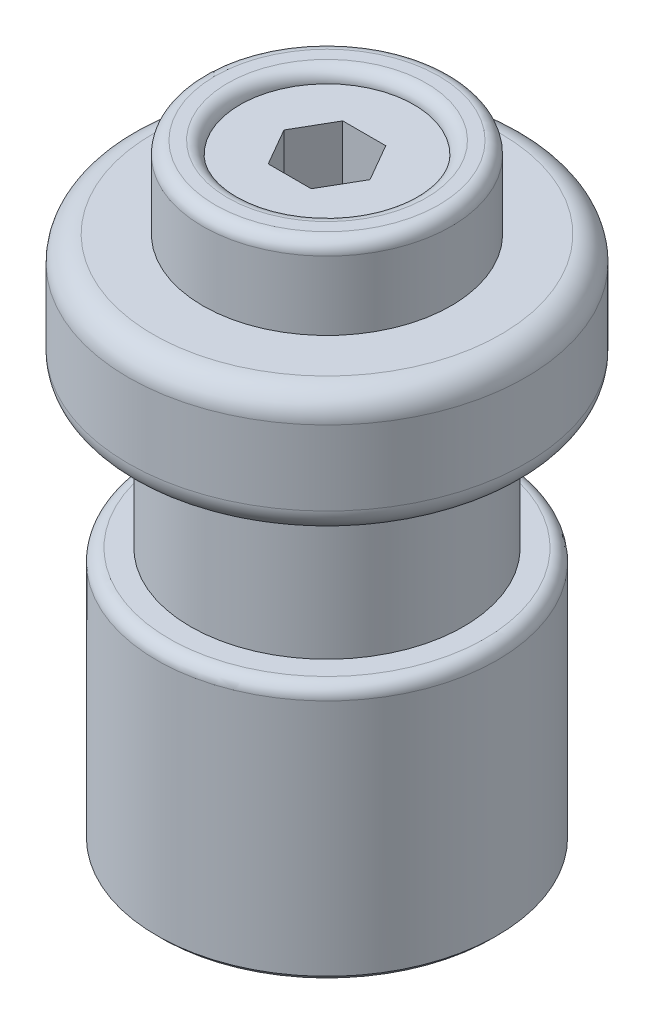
ISO-10303-21;
HEADER;
FILE_DESCRIPTION(('STEP AP214'),'2;1');
FILE_NAME('part.step','',(''),(''),'','','');
FILE_SCHEMA(('AUTOMOTIVE_DESIGN { 1 0 10303 214 1 1 1 1 }'));
ENDSEC;
DATA;
#1=APPLICATION_CONTEXT('core data for automotive mechanical design processes');
#2=APPLICATION_PROTOCOL_DEFINITION('international standard','automotive_design',2000,#1);
#3=PRODUCT_CONTEXT('',#1,'mechanical');
#4=PRODUCT('Part','Part','',(#3));
#5=PRODUCT_RELATED_PRODUCT_CATEGORY('part','',(#4));
#6=PRODUCT_DEFINITION_FORMATION('','',#4);
#7=PRODUCT_DEFINITION_CONTEXT('part definition',#1,'design');
#8=PRODUCT_DEFINITION('design','',#6,#7);
#9=PRODUCT_DEFINITION_SHAPE('','',#8);
#10=(LENGTH_UNIT() NAMED_UNIT(*) SI_UNIT(.MILLI.,.METRE.));
#11=(NAMED_UNIT(*) PLANE_ANGLE_UNIT() SI_UNIT($,.RADIAN.));
#12=(NAMED_UNIT(*) SI_UNIT($,.STERADIAN.) SOLID_ANGLE_UNIT());
#13=UNCERTAINTY_MEASURE_WITH_UNIT(LENGTH_MEASURE(1.E-05),#10,'distance_accuracy_value','');
#14=(GEOMETRIC_REPRESENTATION_CONTEXT(3) GLOBAL_UNCERTAINTY_ASSIGNED_CONTEXT((#13)) GLOBAL_UNIT_ASSIGNED_CONTEXT((#10,
#11,#12)) REPRESENTATION_CONTEXT('',''));
#15=CARTESIAN_POINT('',(0.,0.,0.));
#16=DIRECTION('',(0.,0.,1.));
#17=DIRECTION('',(1.,0.,0.));
#18=AXIS2_PLACEMENT_3D('',#15,#16,#17);
#19=CARTESIAN_POINT('',(0.,10.3,0.));
#20=DIRECTION('',(0.,1.,0.));
#21=DIRECTION('',(0.,0.,1.));
#22=AXIS2_PLACEMENT_3D('',#19,#20,#21);
#23=PLANE('',#22);
#24=CARTESIAN_POINT('',(0.,10.3,0.));
#25=DIRECTION('',(0.,1.,0.));
#26=DIRECTION('',(0.,0.,1.));
#27=AXIS2_PLACEMENT_3D('',#24,#25,#26);
#28=CIRCLE('',#27,5.5);
#29=CARTESIAN_POINT('',(0.,10.3,5.5));
#30=VERTEX_POINT('',#29);
#31=EDGE_CURVE('E157',#30,#30,#28,.F.);
#32=ORIENTED_EDGE('',*,*,#31,.T.);
#33=EDGE_LOOP('',(#32));
#34=FACE_BOUND('',#33,.T.);
#35=CARTESIAN_POINT('',(0.,10.3,0.));
#36=DIRECTION('',(0.,-1.,0.));
#37=DIRECTION('',(-0.0644651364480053,0.,0.997919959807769));
#38=AXIS2_PLACEMENT_3D('',#35,#36,#37);
#39=CIRCLE('',#38,6.35);
#40=CARTESIAN_POINT('',(-0.409353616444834,10.3,6.33679174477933));
#41=VERTEX_POINT('',#40);
#42=EDGE_CURVE('E82',#41,#41,#39,.F.);
#43=ORIENTED_EDGE('',*,*,#42,.T.);
#44=EDGE_LOOP('',(#43));
#45=FACE_BOUND('',#44,.T.);
#46=ADVANCED_FACE('F15',(#34,#45),#23,.T.);
#47=CARTESIAN_POINT('',(0.,15.235225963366,0.));
#48=DIRECTION('',(0.,-1.,0.));
#49=DIRECTION('',(0.,0.,-1.));
#50=AXIS2_PLACEMENT_3D('',#47,#48,#49);
#51=TOROIDAL_SURFACE('',#50,6.5,1.);
#52=CARTESIAN_POINT('',(0.,15.235225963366,0.));
#53=DIRECTION('',(0.,-1.,0.));
#54=DIRECTION('',(0.,0.,-1.));
#55=AXIS2_PLACEMENT_3D('',#52,#53,#54);
#56=CIRCLE('',#55,5.5);
#57=CARTESIAN_POINT('',(0.,15.235225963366,-5.5));
#58=VERTEX_POINT('',#57);
#59=EDGE_CURVE('E137',#58,#58,#56,.T.);
#60=ORIENTED_EDGE('',*,*,#59,.F.);
#61=EDGE_LOOP('',(#60));
#62=FACE_BOUND('',#61,.T.);
#63=CARTESIAN_POINT('',(0.,16.235225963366,0.));
#64=DIRECTION('',(0.,-1.,0.));
#65=DIRECTION('',(0.,0.,-1.));
#66=AXIS2_PLACEMENT_3D('',#63,#64,#65);
#67=CIRCLE('',#66,6.5);
#68=CARTESIAN_POINT('',(0.,16.235225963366,-6.5));
#69=VERTEX_POINT('',#68);
#70=EDGE_CURVE('E133',#69,#69,#67,.T.);
#71=ORIENTED_EDGE('',*,*,#70,.T.);
#72=EDGE_LOOP('',(#71));
#73=FACE_BOUND('',#72,.T.);
#74=ADVANCED_FACE('F222',(#62,#73),#51,.F.);
#75=CARTESIAN_POINT('',(0.,6.23522596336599,0.));
#76=DIRECTION('',(0.,-1.,0.));
#77=DIRECTION('',(0.,0.,-1.));
#78=AXIS2_PLACEMENT_3D('',#75,#76,#77);
#79=CYLINDRICAL_SURFACE('',#78,5.5);
#80=ORIENTED_EDGE('',*,*,#31,.F.);
#81=EDGE_LOOP('',(#80));
#82=FACE_BOUND('',#81,.T.);
#83=ORIENTED_EDGE('',*,*,#59,.T.);
#84=EDGE_LOOP('',(#83));
#85=FACE_BOUND('',#84,.T.);
#86=ADVANCED_FACE('F228',(#82,#85),#79,.T.);
#87=CARTESIAN_POINT('',(0.,6.23522596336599,0.));
#88=DIRECTION('',(0.,-1.,0.));
#89=DIRECTION('',(0.,0.,-1.));
#90=AXIS2_PLACEMENT_3D('',#87,#88,#89);
#91=CYLINDRICAL_SURFACE('',#90,8.);
#92=CARTESIAN_POINT('',(0.,20.235225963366,0.));
#93=DIRECTION('',(0.,-1.,0.));
#94=DIRECTION('',(0.,0.,-1.));
#95=AXIS2_PLACEMENT_3D('',#92,#93,#94);
#96=CIRCLE('',#95,8.);
#97=CARTESIAN_POINT('',(0.,20.235225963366,-8.));
#98=VERTEX_POINT('',#97);
#99=EDGE_CURVE('E149',#98,#98,#96,.T.);
#100=ORIENTED_EDGE('',*,*,#99,.T.);
#101=EDGE_LOOP('',(#100));
#102=FACE_BOUND('',#101,.T.);
#103=CARTESIAN_POINT('',(0.,17.235225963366,0.));
#104=DIRECTION('',(0.,1.,0.));
#105=DIRECTION('',(0.,0.,1.));
#106=AXIS2_PLACEMENT_3D('',#103,#104,#105);
#107=CIRCLE('',#106,8.);
#108=CARTESIAN_POINT('',(0.,17.235225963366,8.));
#109=VERTEX_POINT('',#108);
#110=EDGE_CURVE('E145',#109,#109,#107,.T.);
#111=ORIENTED_EDGE('',*,*,#110,.T.);
#112=EDGE_LOOP('',(#111));
#113=FACE_BOUND('',#112,.T.);
#114=ADVANCED_FACE('F526',(#102,#113),#91,.T.);
#115=CARTESIAN_POINT('',(-6.5,16.235225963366,0.));
#116=DIRECTION('',(0.,1.,0.));
#117=DIRECTION('',(0.,0.,1.));
#118=AXIS2_PLACEMENT_3D('',#115,#116,#117);
#119=PLANE('',#118);
#120=CARTESIAN_POINT('',(0.,16.235225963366,0.));
#121=DIRECTION('',(0.,1.,0.));
#122=DIRECTION('',(0.,0.,1.));
#123=AXIS2_PLACEMENT_3D('',#120,#121,#122);
#124=CIRCLE('',#123,7.);
#125=CARTESIAN_POINT('',(0.,16.235225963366,7.));
#126=VERTEX_POINT('',#125);
#127=EDGE_CURVE('E141',#126,#126,#124,.F.);
#128=ORIENTED_EDGE('',*,*,#127,.T.);
#129=EDGE_LOOP('',(#128));
#130=FACE_BOUND('',#129,.T.);
#131=ORIENTED_EDGE('',*,*,#70,.F.);
#132=EDGE_LOOP('',(#131));
#133=FACE_BOUND('',#132,.T.);
#134=ADVANCED_FACE('F517',(#130,#133),#119,.F.);
#135=CARTESIAN_POINT('',(0.,17.235225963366,0.));
#136=DIRECTION('',(0.,1.,0.));
#137=DIRECTION('',(0.,0.,1.));
#138=AXIS2_PLACEMENT_3D('',#135,#136,#137);
#139=TOROIDAL_SURFACE('',#138,7.,1.);
#140=ORIENTED_EDGE('',*,*,#110,.F.);
#141=EDGE_LOOP('',(#140));
#142=FACE_BOUND('',#141,.T.);
#143=ORIENTED_EDGE('',*,*,#127,.F.);
#144=EDGE_LOOP('',(#143));
#145=FACE_BOUND('',#144,.T.);
#146=ADVANCED_FACE('F508',(#142,#145),#139,.T.);
#147=CARTESIAN_POINT('',(0.,20.235225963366,0.));
#148=DIRECTION('',(0.,-1.,0.));
#149=DIRECTION('',(0.,0.,-1.));
#150=AXIS2_PLACEMENT_3D('',#147,#148,#149);
#151=TOROIDAL_SURFACE('',#150,7.,1.);
#152=CARTESIAN_POINT('',(0.,21.235225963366,0.));
#153=DIRECTION('',(0.,-1.,0.));
#154=DIRECTION('',(0.,0.,-1.));
#155=AXIS2_PLACEMENT_3D('',#152,#153,#154);
#156=CIRCLE('',#155,7.);
#157=CARTESIAN_POINT('',(0.,21.235225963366,-7.));
#158=VERTEX_POINT('',#157);
#159=EDGE_CURVE('E153',#158,#158,#156,.F.);
#160=ORIENTED_EDGE('',*,*,#159,.F.);
#161=EDGE_LOOP('',(#160));
#162=FACE_BOUND('',#161,.T.);
#163=ORIENTED_EDGE('',*,*,#99,.F.);
#164=EDGE_LOOP('',(#163));
#165=FACE_BOUND('',#164,.T.);
#166=ADVANCED_FACE('F500',(#162,#165),#151,.T.);
#167=CARTESIAN_POINT('',(0.,21.235225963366,0.));
#168=DIRECTION('',(0.,1.,0.));
#169=DIRECTION('',(0.,0.,1.));
#170=AXIS2_PLACEMENT_3D('',#167,#168,#169);
#171=PLANE('',#170);
#172=CARTESIAN_POINT('',(0.,21.235225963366,0.));
#173=DIRECTION('',(0.,1.,0.));
#174=DIRECTION('',(0.,0.,1.));
#175=AXIS2_PLACEMENT_3D('',#172,#173,#174);
#176=CIRCLE('',#175,5.);
#177=CARTESIAN_POINT('',(0.,21.235225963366,5.));
#178=VERTEX_POINT('',#177);
#179=EDGE_CURVE('E194',#178,#178,#176,.T.);
#180=ORIENTED_EDGE('',*,*,#179,.F.);
#181=EDGE_LOOP('',(#180));
#182=FACE_BOUND('',#181,.T.);
#183=ORIENTED_EDGE('',*,*,#159,.T.);
#184=EDGE_LOOP('',(#183));
#185=FACE_BOUND('',#184,.T.);
#186=ADVANCED_FACE('F234',(#182,#185),#171,.T.);
#187=CARTESIAN_POINT('',(0.,20.5,0.));
#188=DIRECTION('',(0.,-1.,0.));
#189=DIRECTION('',(0.,0.,-1.));
#190=AXIS2_PLACEMENT_3D('',#187,#188,#189);
#191=CYLINDRICAL_SURFACE('',#190,5.);
#192=ORIENTED_EDGE('',*,*,#179,.T.);
#193=EDGE_LOOP('',(#192));
#194=FACE_BOUND('',#193,.T.);
#195=CARTESIAN_POINT('',(0.,24.,0.));
#196=DIRECTION('',(0.,1.,0.));
#197=DIRECTION('',(0.,0.,1.));
#198=AXIS2_PLACEMENT_3D('',#195,#196,#197);
#199=CIRCLE('',#198,5.);
#200=CARTESIAN_POINT('',(0.,24.,5.));
#201=VERTEX_POINT('',#200);
#202=EDGE_CURVE('E129',#201,#201,#199,.F.);
#203=ORIENTED_EDGE('',*,*,#202,.T.);
#204=EDGE_LOOP('',(#203));
#205=FACE_BOUND('',#204,.T.);
#206=ADVANCED_FACE('F483',(#194,#205),#191,.T.);
#207=CARTESIAN_POINT('',(5.,24.5,0.));
#208=DIRECTION('',(0.,1.,0.));
#209=DIRECTION('',(0.,0.,1.));
#210=AXIS2_PLACEMENT_3D('',#207,#208,#209);
#211=PLANE('',#210);
#212=CARTESIAN_POINT('',(0.,24.5,0.));
#213=DIRECTION('',(0.,1.,0.));
#214=DIRECTION('',(0.,0.,1.));
#215=AXIS2_PLACEMENT_3D('',#212,#213,#214);
#216=CIRCLE('',#215,4.);
#217=CARTESIAN_POINT('',(0.,24.5,4.));
#218=VERTEX_POINT('',#217);
#219=EDGE_CURVE('E120',#218,#218,#216,.F.);
#220=ORIENTED_EDGE('',*,*,#219,.T.);
#221=EDGE_LOOP('',(#220));
#222=FACE_BOUND('',#221,.T.);
#223=CARTESIAN_POINT('',(0.,24.5,0.));
#224=DIRECTION('',(0.,1.,0.));
#225=DIRECTION('',(0.,0.,1.));
#226=AXIS2_PLACEMENT_3D('',#223,#224,#225);
#227=CIRCLE('',#226,4.5);
#228=CARTESIAN_POINT('',(0.,24.5,4.5));
#229=VERTEX_POINT('',#228);
#230=EDGE_CURVE('E116',#229,#229,#227,.T.);
#231=ORIENTED_EDGE('',*,*,#230,.T.);
#232=EDGE_LOOP('',(#231));
#233=FACE_BOUND('',#232,.T.);
#234=ADVANCED_FACE('F474',(#222,#233),#211,.T.);
#235=CARTESIAN_POINT('',(0.,24.,0.));
#236=DIRECTION('',(0.,1.,0.));
#237=DIRECTION('',(0.,0.,1.));
#238=AXIS2_PLACEMENT_3D('',#235,#236,#237);
#239=TOROIDAL_SURFACE('',#238,4.,0.5);
#240=CARTESIAN_POINT('',(0.,24.,0.));
#241=DIRECTION('',(0.,1.,0.));
#242=DIRECTION('',(0.,0.,1.));
#243=AXIS2_PLACEMENT_3D('',#240,#241,#242);
#244=CIRCLE('',#243,3.5);
#245=CARTESIAN_POINT('',(0.,24.,3.5));
#246=VERTEX_POINT('',#245);
#247=EDGE_CURVE('E125',#246,#246,#244,.T.);
#248=ORIENTED_EDGE('',*,*,#247,.F.);
#249=EDGE_LOOP('',(#248));
#250=FACE_BOUND('',#249,.T.);
#251=ORIENTED_EDGE('',*,*,#219,.F.);
#252=EDGE_LOOP('',(#251));
#253=FACE_BOUND('',#252,.T.);
#254=ADVANCED_FACE('F465',(#250,#253),#239,.T.);
#255=CARTESIAN_POINT('',(0.,24.,0.));
#256=DIRECTION('',(0.,1.,0.));
#257=DIRECTION('',(0.,0.,1.));
#258=AXIS2_PLACEMENT_3D('',#255,#256,#257);
#259=TOROIDAL_SURFACE('',#258,4.5,0.5);
#260=ORIENTED_EDGE('',*,*,#230,.F.);
#261=EDGE_LOOP('',(#260));
#262=FACE_BOUND('',#261,.T.);
#263=ORIENTED_EDGE('',*,*,#202,.F.);
#264=EDGE_LOOP('',(#263));
#265=FACE_BOUND('',#264,.T.);
#266=ADVANCED_FACE('F457',(#262,#265),#259,.T.);
#267=CARTESIAN_POINT('',(0.,24.,0.));
#268=DIRECTION('',(0.,-1.,0.));
#269=DIRECTION('',(0.,0.,-1.));
#270=AXIS2_PLACEMENT_3D('',#267,#268,#269);
#271=PLANE('',#270);
#272=ORIENTED_EDGE('',*,*,#247,.T.);
#273=EDGE_LOOP('',(#272));
#274=FACE_BOUND('',#273,.T.);
#275=DIRECTION('',(1.00000000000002,0.,0.));
#276=VECTOR('',#275,1.);
#277=CARTESIAN_POINT('',(-0.866025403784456,24.,-1.50000000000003));
#278=LINE('',#277,#276);
#279=CARTESIAN_POINT('',(0.866025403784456,24.,-1.50000000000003));
#280=VERTEX_POINT('',#279);
#281=CARTESIAN_POINT('',(-0.866025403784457,24.,-1.50000000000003));
#282=VERTEX_POINT('',#281);
#283=EDGE_CURVE('E40',#280,#282,#278,.F.);
#284=ORIENTED_EDGE('',*,*,#283,.F.);
#285=DIRECTION('',(-0.500000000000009,0.,-0.866025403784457));
#286=VECTOR('',#285,1.);
#287=CARTESIAN_POINT('',(0.866025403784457,24.,-1.50000000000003));
#288=LINE('',#287,#286);
#289=CARTESIAN_POINT('',(1.73205080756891,24.,0.));
#290=VERTEX_POINT('',#289);
#291=EDGE_CURVE('E76',#290,#280,#288,.T.);
#292=ORIENTED_EDGE('',*,*,#291,.F.);
#293=DIRECTION('',(0.500000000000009,0.,-0.866025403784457));
#294=VECTOR('',#293,1.);
#295=CARTESIAN_POINT('',(1.73205080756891,24.,0.));
#296=LINE('',#295,#294);
#297=CARTESIAN_POINT('',(0.866025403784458,24.,1.50000000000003));
#298=VERTEX_POINT('',#297);
#299=EDGE_CURVE('E69',#298,#290,#296,.T.);
#300=ORIENTED_EDGE('',*,*,#299,.F.);
#301=DIRECTION('',(1.00000000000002,0.,0.));
#302=VECTOR('',#301,1.);
#303=CARTESIAN_POINT('',(0.866025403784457,24.,1.50000000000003));
#304=LINE('',#303,#302);
#305=CARTESIAN_POINT('',(-0.866025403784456,24.,1.50000000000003));
#306=VERTEX_POINT('',#305);
#307=EDGE_CURVE('E73',#306,#298,#304,.T.);
#308=ORIENTED_EDGE('',*,*,#307,.F.);
#309=DIRECTION('',(0.500000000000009,0.,0.866025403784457));
#310=VECTOR('',#309,1.);
#311=CARTESIAN_POINT('',(-0.866025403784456,24.,1.50000000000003));
#312=LINE('',#311,#310);
#313=CARTESIAN_POINT('',(-1.73205080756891,24.,0.));
#314=VERTEX_POINT('',#313);
#315=EDGE_CURVE('E112',#314,#306,#312,.T.);
#316=ORIENTED_EDGE('',*,*,#315,.F.);
#317=DIRECTION('',(-0.50000000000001,0.,0.866025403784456));
#318=VECTOR('',#317,1.);
#319=CARTESIAN_POINT('',(-0.866025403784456,24.,-1.50000000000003));
#320=LINE('',#319,#318);
#321=EDGE_CURVE('E121',#282,#314,#320,.T.);
#322=ORIENTED_EDGE('',*,*,#321,.F.);
#323=EDGE_LOOP('',(#284,#292,#300,#308,#316,#322));
#324=FACE_BOUND('',#323,.T.);
#325=ADVANCED_FACE('F71',(#274,#324),#271,.F.);
#326=CARTESIAN_POINT('',(1.73205080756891,21.,0.));
#327=DIRECTION('',(-0.866025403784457,0.,-0.500000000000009));
#328=DIRECTION('',(0.500000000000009,0.,-0.866025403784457));
#329=AXIS2_PLACEMENT_3D('',#326,#327,#328);
#330=PLANE('',#329);
#331=DIRECTION('',(0.500000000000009,0.,-0.866025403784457));
#332=VECTOR('',#331,1.);
#333=CARTESIAN_POINT('',(1.73205080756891,21.,0.));
#334=LINE('',#333,#332);
#335=CARTESIAN_POINT('',(1.73205080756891,21.,0.));
#336=VERTEX_POINT('',#335);
#337=CARTESIAN_POINT('',(0.866025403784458,21.,1.50000000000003));
#338=VERTEX_POINT('',#337);
#339=EDGE_CURVE('E81',#336,#338,#334,.F.);
#340=ORIENTED_EDGE('',*,*,#339,.T.);
#341=DIRECTION('',(0.,1.,0.));
#342=VECTOR('',#341,1.);
#343=CARTESIAN_POINT('',(0.866025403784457,21.,1.50000000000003));
#344=LINE('',#343,#342);
#345=EDGE_CURVE('E86',#298,#338,#344,.F.);
#346=ORIENTED_EDGE('',*,*,#345,.F.);
#347=ORIENTED_EDGE('',*,*,#299,.T.);
#348=DIRECTION('',(0.,-1.,0.));
#349=VECTOR('',#348,1.);
#350=CARTESIAN_POINT('',(1.73205080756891,21.,0.));
#351=LINE('',#350,#349);
#352=EDGE_CURVE('E110',#336,#290,#351,.F.);
#353=ORIENTED_EDGE('',*,*,#352,.F.);
#354=EDGE_LOOP('',(#340,#346,#347,#353));
#355=FACE_BOUND('',#354,.T.);
#356=ADVANCED_FACE('F87',(#355),#330,.T.);
#357=CARTESIAN_POINT('',(0.866025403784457,21.,1.50000000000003));
#358=DIRECTION('',(0.,0.,-1.00000000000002));
#359=DIRECTION('',(0.,1.,0.));
#360=AXIS2_PLACEMENT_3D('',#357,#358,#359);
#361=PLANE('',#360);
#362=DIRECTION('',(1.00000000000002,0.,0.));
#363=VECTOR('',#362,1.);
#364=CARTESIAN_POINT('',(0.,21.,1.50000000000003));
#365=LINE('',#364,#363);
#366=CARTESIAN_POINT('',(-0.866025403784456,21.,1.50000000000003));
#367=VERTEX_POINT('',#366);
#368=EDGE_CURVE('E91',#338,#367,#365,.F.);
#369=ORIENTED_EDGE('',*,*,#368,.T.);
#370=DIRECTION('',(0.,-1.,0.));
#371=VECTOR('',#370,1.);
#372=CARTESIAN_POINT('',(-0.866025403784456,21.,1.50000000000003));
#373=LINE('',#372,#371);
#374=EDGE_CURVE('E95',#306,#367,#373,.T.);
#375=ORIENTED_EDGE('',*,*,#374,.F.);
#376=ORIENTED_EDGE('',*,*,#307,.T.);
#377=ORIENTED_EDGE('',*,*,#345,.T.);
#378=EDGE_LOOP('',(#369,#375,#376,#377));
#379=FACE_BOUND('',#378,.T.);
#380=ADVANCED_FACE('F93',(#379),#361,.T.);
#381=CARTESIAN_POINT('',(0.866025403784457,21.,-1.50000000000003));
#382=DIRECTION('',(-0.866025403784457,0.,0.500000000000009));
#383=DIRECTION('',(-0.500000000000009,0.,-0.866025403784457));
#384=AXIS2_PLACEMENT_3D('',#381,#382,#383);
#385=PLANE('',#384);
#386=DIRECTION('',(-0.500000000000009,0.,-0.866025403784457));
#387=VECTOR('',#386,1.);
#388=CARTESIAN_POINT('',(0.866025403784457,21.,-1.50000000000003));
#389=LINE('',#388,#387);
#390=CARTESIAN_POINT('',(0.866025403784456,21.,-1.50000000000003));
#391=VERTEX_POINT('',#390);
#392=EDGE_CURVE('E106',#391,#336,#389,.F.);
#393=ORIENTED_EDGE('',*,*,#392,.T.);
#394=ORIENTED_EDGE('',*,*,#352,.T.);
#395=ORIENTED_EDGE('',*,*,#291,.T.);
#396=DIRECTION('',(0.,-1.,0.));
#397=VECTOR('',#396,1.);
#398=CARTESIAN_POINT('',(0.866025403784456,21.,-1.50000000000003));
#399=LINE('',#398,#397);
#400=EDGE_CURVE('E599',#391,#280,#399,.F.);
#401=ORIENTED_EDGE('',*,*,#400,.F.);
#402=EDGE_LOOP('',(#393,#394,#395,#401));
#403=FACE_BOUND('',#402,.T.);
#404=ADVANCED_FACE('F426',(#403),#385,.T.);
#405=CARTESIAN_POINT('',(-0.866025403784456,21.,1.50000000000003));
#406=DIRECTION('',(0.866025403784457,0.,-0.500000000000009));
#407=DIRECTION('',(0.500000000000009,0.,0.866025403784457));
#408=AXIS2_PLACEMENT_3D('',#405,#406,#407);
#409=PLANE('',#408);
#410=DIRECTION('',(-0.50000000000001,0.,-0.866025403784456));
#411=VECTOR('',#410,1.);
#412=CARTESIAN_POINT('',(-1.29903810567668,21.,0.750000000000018));
#413=LINE('',#412,#411);
#414=CARTESIAN_POINT('',(-1.73205080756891,20.9999999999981,0.));
#415=VERTEX_POINT('',#414);
#416=EDGE_CURVE('E603',#367,#415,#413,.T.);
#417=ORIENTED_EDGE('',*,*,#416,.T.);
#418=DIRECTION('',(0.,-1.,0.));
#419=VECTOR('',#418,1.);
#420=CARTESIAN_POINT('',(-1.73205080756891,21.,0.));
#421=LINE('',#420,#419);
#422=EDGE_CURVE('E609',#314,#415,#421,.T.);
#423=ORIENTED_EDGE('',*,*,#422,.F.);
#424=ORIENTED_EDGE('',*,*,#315,.T.);
#425=ORIENTED_EDGE('',*,*,#374,.T.);
#426=EDGE_LOOP('',(#417,#423,#424,#425));
#427=FACE_BOUND('',#426,.T.);
#428=ADVANCED_FACE('F418',(#427),#409,.T.);
#429=CARTESIAN_POINT('',(-0.866025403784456,21.,-1.50000000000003));
#430=DIRECTION('',(0.,0.,1.00000000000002));
#431=DIRECTION('',(0.,-1.,0.));
#432=AXIS2_PLACEMENT_3D('',#429,#430,#431);
#433=PLANE('',#432);
#434=DIRECTION('',(1.00000000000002,0.,0.));
#435=VECTOR('',#434,1.);
#436=CARTESIAN_POINT('',(-0.866025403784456,21.,-1.50000000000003));
#437=LINE('',#436,#435);
#438=CARTESIAN_POINT('',(-0.866025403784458,21.,-1.50000000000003));
#439=VERTEX_POINT('',#438);
#440=EDGE_CURVE('E601',#439,#391,#437,.T.);
#441=ORIENTED_EDGE('',*,*,#440,.T.);
#442=ORIENTED_EDGE('',*,*,#400,.T.);
#443=ORIENTED_EDGE('',*,*,#283,.T.);
#444=DIRECTION('',(0.,-1.,0.));
#445=VECTOR('',#444,1.);
#446=CARTESIAN_POINT('',(-0.866025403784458,21.,-1.50000000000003));
#447=LINE('',#446,#445);
#448=EDGE_CURVE('E615',#439,#282,#447,.F.);
#449=ORIENTED_EDGE('',*,*,#448,.F.);
#450=EDGE_LOOP('',(#441,#442,#443,#449));
#451=FACE_BOUND('',#450,.T.);
#452=ADVANCED_FACE('F409',(#451),#433,.T.);
#453=CARTESIAN_POINT('',(-1.73205080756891,21.,0.));
#454=DIRECTION('',(0.866025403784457,0.,0.500000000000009));
#455=DIRECTION('',(-0.500000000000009,0.,0.866025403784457));
#456=AXIS2_PLACEMENT_3D('',#453,#454,#455);
#457=PLANE('',#456);
#458=DIRECTION('',(-0.500000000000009,0.,0.866025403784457));
#459=VECTOR('',#458,1.);
#460=CARTESIAN_POINT('',(-1.73205080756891,21.,0.));
#461=LINE('',#460,#459);
#462=EDGE_CURVE('E31',#415,#439,#461,.F.);
#463=ORIENTED_EDGE('',*,*,#462,.T.);
#464=ORIENTED_EDGE('',*,*,#448,.T.);
#465=ORIENTED_EDGE('',*,*,#321,.T.);
#466=ORIENTED_EDGE('',*,*,#422,.T.);
#467=EDGE_LOOP('',(#463,#464,#465,#466));
#468=FACE_BOUND('',#467,.T.);
#469=ADVANCED_FACE('F401',(#468),#457,.T.);
#470=CARTESIAN_POINT('',(0.,20.9999999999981,0.));
#471=DIRECTION('',(0.,-1.,0.));
#472=DIRECTION('',(0.,0.,-1.));
#473=AXIS2_PLACEMENT_3D('',#470,#471,#472);
#474=PLANE('',#473);
#475=ORIENTED_EDGE('',*,*,#416,.F.);
#476=ORIENTED_EDGE('',*,*,#368,.F.);
#477=ORIENTED_EDGE('',*,*,#339,.F.);
#478=ORIENTED_EDGE('',*,*,#392,.F.);
#479=ORIENTED_EDGE('',*,*,#440,.F.);
#480=ORIENTED_EDGE('',*,*,#462,.F.);
#481=EDGE_LOOP('',(#475,#476,#477,#478,#479,#480));
#482=FACE_BOUND('',#481,.T.);
#483=ADVANCED_FACE('F392',(#482),#474,.F.);
#484=CARTESIAN_POINT('',(0.,0.,0.));
#485=DIRECTION('',(0.,-1.,0.));
#486=DIRECTION('',(-0.0644651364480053,0.,0.997919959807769));
#487=AXIS2_PLACEMENT_3D('',#484,#485,#486);
#488=CYLINDRICAL_SURFACE('',#487,6.85);
#489=CARTESIAN_POINT('',(0.,9.8,0.));
#490=DIRECTION('',(0.,-1.,0.));
#491=DIRECTION('',(-0.0644651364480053,0.,0.997919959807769));
#492=AXIS2_PLACEMENT_3D('',#489,#490,#491);
#493=CIRCLE('',#492,6.85);
#494=CARTESIAN_POINT('',(-0.441586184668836,9.8,6.83575172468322));
#495=VERTEX_POINT('',#494);
#496=EDGE_CURVE('E631',#495,#495,#493,.T.);
#497=ORIENTED_EDGE('',*,*,#496,.T.);
#498=EDGE_LOOP('',(#497));
#499=FACE_BOUND('',#498,.T.);
#500=CARTESIAN_POINT('',(0.,0.2,0.));
#501=DIRECTION('',(0.,1.,0.));
#502=DIRECTION('',(0.0644651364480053,0.,-0.997919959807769));
#503=AXIS2_PLACEMENT_3D('',#500,#501,#502);
#504=CIRCLE('',#503,6.85);
#505=CARTESIAN_POINT('',(0.441586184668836,0.2,-6.83575172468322));
#506=VERTEX_POINT('',#505);
#507=EDGE_CURVE('E635',#506,#506,#504,.T.);
#508=ORIENTED_EDGE('',*,*,#507,.T.);
#509=EDGE_LOOP('',(#508));
#510=FACE_BOUND('',#509,.T.);
#511=ADVANCED_FACE('F383',(#499,#510),#488,.T.);
#512=CARTESIAN_POINT('',(0.,0.,0.));
#513=DIRECTION('',(0.,1.,0.));
#514=DIRECTION('',(0.0644651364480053,0.,-0.997919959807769));
#515=AXIS2_PLACEMENT_3D('',#512,#513,#514);
#516=CONICAL_SURFACE('',#515,6.65,0.785398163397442);
#517=ORIENTED_EDGE('',*,*,#507,.F.);
#518=EDGE_LOOP('',(#517));
#519=FACE_BOUND('',#518,.T.);
#520=CARTESIAN_POINT('',(0.,0.,0.));
#521=DIRECTION('',(0.,1.,0.));
#522=DIRECTION('',(0.0644651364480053,0.,-0.997919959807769));
#523=AXIS2_PLACEMENT_3D('',#520,#521,#522);
#524=CIRCLE('',#523,6.65);
#525=CARTESIAN_POINT('',(0.428693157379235,0.,-6.63616773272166));
#526=VERTEX_POINT('',#525);
#527=EDGE_CURVE('E639',#526,#526,#524,.F.);
#528=ORIENTED_EDGE('',*,*,#527,.F.);
#529=EDGE_LOOP('',(#528));
#530=FACE_BOUND('',#529,.T.);
#531=ADVANCED_FACE('F374',(#519,#530),#516,.T.);
#532=CARTESIAN_POINT('',(0.,9.8,0.));
#533=DIRECTION('',(0.,-1.,0.));
#534=DIRECTION('',(-0.0644651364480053,0.,0.997919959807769));
#535=AXIS2_PLACEMENT_3D('',#532,#533,#534);
#536=TOROIDAL_SURFACE('',#535,6.35,0.5);
#537=ORIENTED_EDGE('',*,*,#42,.F.);
#538=EDGE_LOOP('',(#537));
#539=FACE_BOUND('',#538,.T.);
#540=ORIENTED_EDGE('',*,*,#496,.F.);
#541=EDGE_LOOP('',(#540));
#542=FACE_BOUND('',#541,.T.);
#543=ADVANCED_FACE('F250',(#539,#542),#536,.T.);
#544=CARTESIAN_POINT('',(0.,-3.,0.));
#545=DIRECTION('',(0.,-1.,0.));
#546=DIRECTION('',(0.,0.,-1.));
#547=AXIS2_PLACEMENT_3D('',#544,#545,#546);
#548=CYLINDRICAL_SURFACE('',#547,2.1);
#549=CARTESIAN_POINT('',(0.,10.2,0.));
#550=DIRECTION('',(0.,-1.,0.));
#551=DIRECTION('',(0.,0.,-1.));
#552=AXIS2_PLACEMENT_3D('',#549,#550,#551);
#553=CIRCLE('',#552,2.1);
#554=CARTESIAN_POINT('',(0.,10.2,-2.1));
#555=VERTEX_POINT('',#554);
#556=EDGE_CURVE('E190',#555,#555,#553,.T.);
#557=ORIENTED_EDGE('',*,*,#556,.F.);
#558=EDGE_LOOP('',(#557));
#559=FACE_BOUND('',#558,.T.);
#560=CARTESIAN_POINT('',(0.,7.5,0.));
#561=DIRECTION('',(0.,-1.,0.));
#562=DIRECTION('',(0.,0.,-1.));
#563=AXIS2_PLACEMENT_3D('',#560,#561,#562);
#564=CIRCLE('',#563,2.1);
#565=CARTESIAN_POINT('',(0.,7.5,-2.1));
#566=VERTEX_POINT('',#565);
#567=EDGE_CURVE('E162',#566,#566,#564,.T.);
#568=ORIENTED_EDGE('',*,*,#567,.T.);
#569=EDGE_LOOP('',(#568));
#570=FACE_BOUND('',#569,.T.);
#571=ADVANCED_FACE('F246',(#559,#570),#548,.F.);
#572=CARTESIAN_POINT('',(-2.1,7.5,0.));
#573=DIRECTION('',(0.,1.,0.));
#574=DIRECTION('',(0.,0.,1.));
#575=AXIS2_PLACEMENT_3D('',#572,#573,#574);
#576=PLANE('',#575);
#577=CARTESIAN_POINT('',(0.,7.5,0.));
#578=DIRECTION('',(0.,-1.,0.));
#579=DIRECTION('',(0.,0.,-1.));
#580=AXIS2_PLACEMENT_3D('',#577,#578,#579);
#581=CIRCLE('',#580,1.9);
#582=CARTESIAN_POINT('',(0.,7.5,-1.9));
#583=VERTEX_POINT('',#582);
#584=EDGE_CURVE('E158',#583,#583,#581,.T.);
#585=ORIENTED_EDGE('',*,*,#584,.T.);
#586=EDGE_LOOP('',(#585));
#587=FACE_BOUND('',#586,.T.);
#588=ORIENTED_EDGE('',*,*,#567,.F.);
#589=EDGE_LOOP('',(#588));
#590=FACE_BOUND('',#589,.T.);
#591=ADVANCED_FACE('F242',(#587,#590),#576,.T.);
#592=CARTESIAN_POINT('',(0.,-3.,0.));
#593=DIRECTION('',(0.,-1.,0.));
#594=DIRECTION('',(0.,0.,-1.));
#595=AXIS2_PLACEMENT_3D('',#592,#593,#594);
#596=CYLINDRICAL_SURFACE('',#595,1.9);
#597=CARTESIAN_POINT('',(0.,6.1,0.));
#598=DIRECTION('',(0.,-1.,0.));
#599=DIRECTION('',(0.,0.,-1.));
#600=AXIS2_PLACEMENT_3D('',#597,#598,#599);
#601=CIRCLE('',#600,1.9);
#602=CARTESIAN_POINT('',(0.,6.1,-1.9));
#603=VERTEX_POINT('',#602);
#604=EDGE_CURVE('E174',#603,#603,#601,.T.);
#605=ORIENTED_EDGE('',*,*,#604,.T.);
#606=EDGE_LOOP('',(#605));
#607=FACE_BOUND('',#606,.T.);
#608=ORIENTED_EDGE('',*,*,#584,.F.);
#609=EDGE_LOOP('',(#608));
#610=FACE_BOUND('',#609,.T.);
#611=ADVANCED_FACE('F245',(#607,#610),#596,.F.);
#612=CARTESIAN_POINT('',(0.,5.88161785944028,0.));
#613=DIRECTION('',(0.,-1.,0.));
#614=DIRECTION('',(0.,0.,-1.));
#615=AXIS2_PLACEMENT_3D('',#612,#613,#614);
#616=CONICAL_SURFACE('',#615,2.5,1.22173047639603);
#617=ORIENTED_EDGE('',*,*,#604,.F.);
#618=EDGE_LOOP('',(#617));
#619=FACE_BOUND('',#618,.T.);
#620=CARTESIAN_POINT('',(0.,5.88161785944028,0.));
#621=DIRECTION('',(0.,-1.,0.));
#622=DIRECTION('',(0.,0.,-1.));
#623=AXIS2_PLACEMENT_3D('',#620,#621,#622);
#624=CIRCLE('',#623,2.5);
#625=CARTESIAN_POINT('',(0.,5.88161785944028,-2.5));
#626=VERTEX_POINT('',#625);
#627=EDGE_CURVE('E170',#626,#626,#624,.T.);
#628=ORIENTED_EDGE('',*,*,#627,.T.);
#629=EDGE_LOOP('',(#628));
#630=FACE_BOUND('',#629,.T.);
#631=ADVANCED_FACE('F263',(#619,#630),#616,.F.);
#632=CARTESIAN_POINT('',(0.,-3.,0.));
#633=DIRECTION('',(0.,-1.,0.));
#634=DIRECTION('',(0.,0.,-1.));
#635=AXIS2_PLACEMENT_3D('',#632,#633,#634);
#636=CYLINDRICAL_SURFACE('',#635,2.5);
#637=ORIENTED_EDGE('',*,*,#627,.F.);
#638=EDGE_LOOP('',(#637));
#639=FACE_BOUND('',#638,.T.);
#640=CARTESIAN_POINT('',(0.,-2.49999999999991,0.));
#641=DIRECTION('',(0.,-1.,0.));
#642=DIRECTION('',(0.,0.,-1.));
#643=AXIS2_PLACEMENT_3D('',#640,#641,#642);
#644=CIRCLE('',#643,2.5);
#645=CARTESIAN_POINT('',(0.,-2.49999999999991,-2.5));
#646=VERTEX_POINT('',#645);
#647=EDGE_CURVE('E166',#646,#646,#644,.T.);
#648=ORIENTED_EDGE('',*,*,#647,.T.);
#649=EDGE_LOOP('',(#648));
#650=FACE_BOUND('',#649,.T.);
#651=ADVANCED_FACE('F259',(#639,#650),#636,.F.);
#652=CARTESIAN_POINT('',(-4.,-2.49999999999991,0.));
#653=DIRECTION('',(0.,1.,0.));
#654=DIRECTION('',(0.,0.,1.));
#655=AXIS2_PLACEMENT_3D('',#652,#653,#654);
#656=PLANE('',#655);
#657=CARTESIAN_POINT('',(0.,-2.49999999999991,0.));
#658=DIRECTION('',(0.,1.,0.));
#659=DIRECTION('',(0.,0.,1.));
#660=AXIS2_PLACEMENT_3D('',#657,#658,#659);
#661=CIRCLE('',#660,3.);
#662=CARTESIAN_POINT('',(0.,-2.49999999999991,3.));
#663=VERTEX_POINT('',#662);
#664=EDGE_CURVE('E178',#663,#663,#661,.F.);
#665=ORIENTED_EDGE('',*,*,#664,.T.);
#666=EDGE_LOOP('',(#665));
#667=FACE_BOUND('',#666,.T.);
#668=ORIENTED_EDGE('',*,*,#647,.F.);
#669=EDGE_LOOP('',(#668));
#670=FACE_BOUND('',#669,.T.);
#671=ADVANCED_FACE('F256',(#667,#670),#656,.F.);
#672=CARTESIAN_POINT('',(0.,-2.49999999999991,0.));
#673=DIRECTION('',(0.,1.,0.));
#674=DIRECTION('',(0.,0.,1.));
#675=AXIS2_PLACEMENT_3D('',#672,#673,#674);
#676=CONICAL_SURFACE('',#675,3.,0.785398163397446);
#677=CARTESIAN_POINT('',(0.,-1.4999999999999,0.));
#678=DIRECTION('',(0.,1.,0.));
#679=DIRECTION('',(0.,0.,1.));
#680=AXIS2_PLACEMENT_3D('',#677,#678,#679);
#681=CIRCLE('',#680,4.);
#682=CARTESIAN_POINT('',(0.,-1.4999999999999,4.));
#683=VERTEX_POINT('',#682);
#684=EDGE_CURVE('E182',#683,#683,#681,.T.);
#685=ORIENTED_EDGE('',*,*,#684,.F.);
#686=EDGE_LOOP('',(#685));
#687=FACE_BOUND('',#686,.T.);
#688=ORIENTED_EDGE('',*,*,#664,.F.);
#689=EDGE_LOOP('',(#688));
#690=FACE_BOUND('',#689,.T.);
#691=ADVANCED_FACE('F254',(#687,#690),#676,.T.);
#692=CARTESIAN_POINT('',(0.,-3.,0.));
#693=DIRECTION('',(0.,-1.,0.));
#694=DIRECTION('',(0.,0.,-1.));
#695=AXIS2_PLACEMENT_3D('',#692,#693,#694);
#696=CYLINDRICAL_SURFACE('',#695,4.);
#697=ORIENTED_EDGE('',*,*,#684,.T.);
#698=EDGE_LOOP('',(#697));
#699=FACE_BOUND('',#698,.T.);
#700=CARTESIAN_POINT('',(0.,0.,0.));
#701=DIRECTION('',(0.,1.,0.));
#702=DIRECTION('',(0.,0.,1.));
#703=AXIS2_PLACEMENT_3D('',#700,#701,#702);
#704=CIRCLE('',#703,4.);
#705=CARTESIAN_POINT('',(0.,0.,4.));
#706=VERTEX_POINT('',#705);
#707=EDGE_CURVE('E186',#706,#706,#704,.T.);
#708=ORIENTED_EDGE('',*,*,#707,.F.);
#709=EDGE_LOOP('',(#708));
#710=FACE_BOUND('',#709,.T.);
#711=ADVANCED_FACE('F240',(#699,#710),#696,.T.);
#712=CARTESIAN_POINT('',(0.,0.,0.));
#713=DIRECTION('',(0.,1.,0.));
#714=DIRECTION('',(0.,0.,1.));
#715=AXIS2_PLACEMENT_3D('',#712,#713,#714);
#716=PLANE('',#715);
#717=ORIENTED_EDGE('',*,*,#527,.T.);
#718=EDGE_LOOP('',(#717));
#719=FACE_BOUND('',#718,.T.);
#720=ORIENTED_EDGE('',*,*,#707,.T.);
#721=EDGE_LOOP('',(#720));
#722=FACE_BOUND('',#721,.T.);
#723=ADVANCED_FACE('F236',(#719,#722),#716,.F.);
#724=CARTESIAN_POINT('',(0.,10.2,0.));
#725=DIRECTION('',(0.,1.,0.));
#726=DIRECTION('',(0.,0.,1.));
#727=AXIS2_PLACEMENT_3D('',#724,#725,#726);
#728=PLANE('',#727);
#729=CARTESIAN_POINT('',(0.,10.2,0.));
#730=DIRECTION('',(0.,1.,0.));
#731=DIRECTION('',(0.,0.,1.));
#732=AXIS2_PLACEMENT_3D('',#729,#730,#731);
#733=CIRCLE('',#732,1.9);
#734=CARTESIAN_POINT('',(0.,10.2,1.9));
#735=VERTEX_POINT('',#734);
#736=EDGE_CURVE('E201',#735,#735,#733,.T.);
#737=ORIENTED_EDGE('',*,*,#736,.T.);
#738=EDGE_LOOP('',(#737));
#739=FACE_BOUND('',#738,.T.);
#740=ORIENTED_EDGE('',*,*,#556,.T.);
#741=EDGE_LOOP('',(#740));
#742=FACE_BOUND('',#741,.T.);
#743=ADVANCED_FACE('F239',(#739,#742),#728,.F.);
#744=CARTESIAN_POINT('',(1.53602976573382,11.2,0.));
#745=DIRECTION('',(0.,-1.,0.));
#746=DIRECTION('',(0.,0.,-1.));
#747=AXIS2_PLACEMENT_3D('',#744,#745,#746);
#748=PLANE('',#747);
#749=CARTESIAN_POINT('',(0.,11.2,0.));
#750=DIRECTION('',(0.,-1.,0.));
#751=DIRECTION('',(0.,0.,-1.));
#752=AXIS2_PLACEMENT_3D('',#749,#750,#751);
#753=CIRCLE('',#752,1.25594675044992);
#754=CARTESIAN_POINT('',(0.,11.2,-1.25594675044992));
#755=VERTEX_POINT('',#754);
#756=EDGE_CURVE('E9',#755,#755,#753,.T.);
#757=ORIENTED_EDGE('',*,*,#756,.T.);
#758=EDGE_LOOP('',(#757));
#759=FACE_BOUND('',#758,.T.);
#760=ADVANCED_FACE('F218',(#759),#748,.T.);
#761=CARTESIAN_POINT('',(0.,10.2,0.));
#762=DIRECTION('',(0.,-1.,0.));
#763=DIRECTION('',(0.,0.,-1.));
#764=AXIS2_PLACEMENT_3D('',#761,#762,#763);
#765=CONICAL_SURFACE('',#764,1.9,0.34906585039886);
#766=CARTESIAN_POINT('',(0.,10.9368080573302,0.));
#767=DIRECTION('',(0.,-1.,0.));
#768=DIRECTION('',(0.,0.,-1.));
#769=AXIS2_PLACEMENT_3D('',#766,#767,#768);
#770=CIRCLE('',#769,1.63182379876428);
#771=CARTESIAN_POINT('',(0.,10.9368080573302,-1.63182379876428));
#772=VERTEX_POINT('',#771);
#773=EDGE_CURVE('E24',#772,#772,#770,.F.);
#774=ORIENTED_EDGE('',*,*,#773,.T.);
#775=EDGE_LOOP('',(#774));
#776=FACE_BOUND('',#775,.T.);
#777=ORIENTED_EDGE('',*,*,#736,.F.);
#778=EDGE_LOOP('',(#777));
#779=FACE_BOUND('',#778,.T.);
#780=ADVANCED_FACE('F209',(#776,#779),#765,.F.);
#781=CARTESIAN_POINT('',(0.,10.8,0.));
#782=DIRECTION('',(0.,-1.,0.));
#783=DIRECTION('',(0.,0.,-1.));
#784=AXIS2_PLACEMENT_3D('',#781,#782,#783);
#785=TOROIDAL_SURFACE('',#784,1.25594675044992,0.4);
#786=ORIENTED_EDGE('',*,*,#756,.F.);
#787=EDGE_LOOP('',(#786));
#788=FACE_BOUND('',#787,.T.);
#789=ORIENTED_EDGE('',*,*,#773,.F.);
#790=EDGE_LOOP('',(#789));
#791=FACE_BOUND('',#790,.T.);
#792=ADVANCED_FACE('F17',(#788,#791),#785,.F.);
#793=CLOSED_SHELL('',(#46,#74,#86,#114,#134,#146,#166,#186,#206,#234,#254,#266,#325,#356,#380,
#404,#428,#452,#469,#483,#511,#531,#543,#571,#591,#611,#631,#651,#671,#691,#711,#723,#743,#760,
#780,#792));
#794=MANIFOLD_SOLID_BREP('B1',#793);
#795=ADVANCED_BREP_SHAPE_REPRESENTATION('',(#18,#794),#14);
#796=SHAPE_DEFINITION_REPRESENTATION(#9,#795);
ENDSEC;
END-ISO-10303-21;
